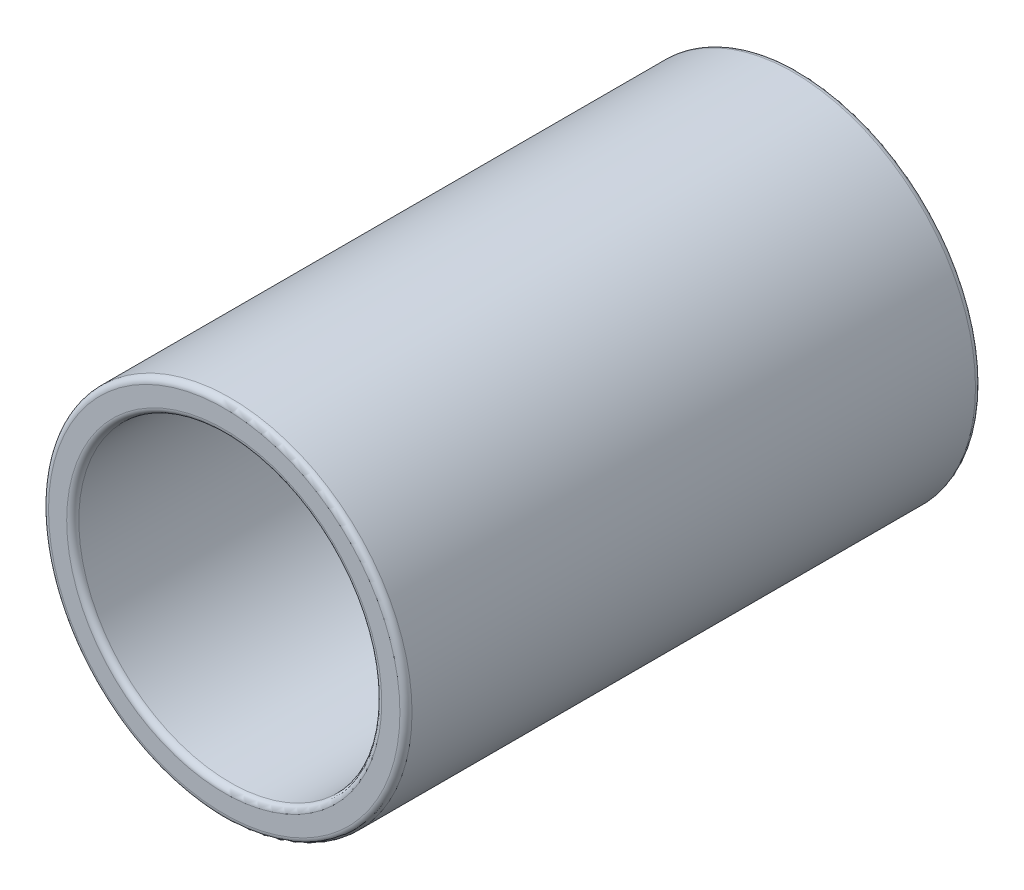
ISO-10303-21;
HEADER;
FILE_DESCRIPTION(('STEP AP214'),'2;1');
FILE_NAME('part.step','',(''),(''),'','','');
FILE_SCHEMA(('AUTOMOTIVE_DESIGN { 1 0 10303 214 1 1 1 1 }'));
ENDSEC;
DATA;
#1=APPLICATION_CONTEXT('core data for automotive mechanical design processes');
#2=APPLICATION_PROTOCOL_DEFINITION('international standard','automotive_design',2000,#1);
#3=PRODUCT_CONTEXT('',#1,'mechanical');
#4=PRODUCT('Part','Part','',(#3));
#5=PRODUCT_RELATED_PRODUCT_CATEGORY('part','',(#4));
#6=PRODUCT_DEFINITION_FORMATION('','',#4);
#7=PRODUCT_DEFINITION_CONTEXT('part definition',#1,'design');
#8=PRODUCT_DEFINITION('design','',#6,#7);
#9=PRODUCT_DEFINITION_SHAPE('','',#8);
#10=(LENGTH_UNIT() NAMED_UNIT(*) SI_UNIT(.MILLI.,.METRE.));
#11=(NAMED_UNIT(*) PLANE_ANGLE_UNIT() SI_UNIT($,.RADIAN.));
#12=(NAMED_UNIT(*) SI_UNIT($,.STERADIAN.) SOLID_ANGLE_UNIT());
#13=UNCERTAINTY_MEASURE_WITH_UNIT(LENGTH_MEASURE(1.E-05),#10,'distance_accuracy_value','');
#14=(GEOMETRIC_REPRESENTATION_CONTEXT(3) GLOBAL_UNCERTAINTY_ASSIGNED_CONTEXT((#13)) GLOBAL_UNIT_ASSIGNED_CONTEXT((#10,
#11,#12)) REPRESENTATION_CONTEXT('',''));
#15=CARTESIAN_POINT('',(0.,0.,0.));
#16=DIRECTION('',(0.,0.,1.));
#17=DIRECTION('',(1.,0.,0.));
#18=AXIS2_PLACEMENT_3D('',#15,#16,#17);
#19=CARTESIAN_POINT('',(0.,0.,9.5));
#20=DIRECTION('',(0.,0.,1.));
#21=DIRECTION('',(1.,0.,0.));
#22=AXIS2_PLACEMENT_3D('',#19,#20,#21);
#23=PLANE('',#22);
#24=CARTESIAN_POINT('',(0.,0.,9.5));
#25=DIRECTION('',(0.,0.,1.));
#26=DIRECTION('',(1.,0.,0.));
#27=AXIS2_PLACEMENT_3D('',#24,#25,#26);
#28=CIRCLE('',#27,2.6);
#29=CARTESIAN_POINT('',(2.6,0.,9.5));
#30=VERTEX_POINT('',#29);
#31=EDGE_CURVE('E39',#30,#30,#28,.F.);
#32=ORIENTED_EDGE('',*,*,#31,.T.);
#33=EDGE_LOOP('',(#32));
#34=FACE_BOUND('',#33,.T.);
#35=CARTESIAN_POINT('',(0.,0.,9.5));
#36=DIRECTION('',(0.,0.,1.));
#37=DIRECTION('',(1.,0.,0.));
#38=AXIS2_PLACEMENT_3D('',#35,#36,#37);
#39=CIRCLE('',#38,2.9);
#40=CARTESIAN_POINT('',(2.9,0.,9.5));
#41=VERTEX_POINT('',#40);
#42=EDGE_CURVE('E43',#41,#41,#39,.T.);
#43=ORIENTED_EDGE('',*,*,#42,.T.);
#44=EDGE_LOOP('',(#43));
#45=FACE_BOUND('',#44,.T.);
#46=ADVANCED_FACE('F28',(#34,#45),#23,.T.);
#47=CARTESIAN_POINT('',(0.,0.,0.));
#48=DIRECTION('',(0.,0.,1.));
#49=DIRECTION('',(1.,0.,0.));
#50=AXIS2_PLACEMENT_3D('',#47,#48,#49);
#51=PLANE('',#50);
#52=CARTESIAN_POINT('',(0.,0.,0.));
#53=DIRECTION('',(0.,0.,1.));
#54=DIRECTION('',(1.,0.,0.));
#55=AXIS2_PLACEMENT_3D('',#52,#53,#54);
#56=CIRCLE('',#55,2.6);
#57=CARTESIAN_POINT('',(2.6,0.,0.));
#58=VERTEX_POINT('',#57);
#59=EDGE_CURVE('E54',#58,#58,#56,.T.);
#60=ORIENTED_EDGE('',*,*,#59,.T.);
#61=EDGE_LOOP('',(#60));
#62=FACE_BOUND('',#61,.T.);
#63=CARTESIAN_POINT('',(0.,0.,0.));
#64=DIRECTION('',(0.,0.,1.));
#65=DIRECTION('',(1.,0.,0.));
#66=AXIS2_PLACEMENT_3D('',#63,#64,#65);
#67=CIRCLE('',#66,2.9);
#68=CARTESIAN_POINT('',(2.9,0.,0.));
#69=VERTEX_POINT('',#68);
#70=EDGE_CURVE('E57',#69,#69,#67,.F.);
#71=ORIENTED_EDGE('',*,*,#70,.T.);
#72=EDGE_LOOP('',(#71));
#73=FACE_BOUND('',#72,.T.);
#74=ADVANCED_FACE('F61',(#62,#73),#51,.F.);
#75=CARTESIAN_POINT('',(0.,0.,9.5));
#76=DIRECTION('',(0.,0.,-1.));
#77=DIRECTION('',(-1.,0.,0.));
#78=AXIS2_PLACEMENT_3D('',#75,#76,#77);
#79=CYLINDRICAL_SURFACE('',#78,3.);
#80=CARTESIAN_POINT('',(0.,0.,0.0999999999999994));
#81=DIRECTION('',(0.,0.,1.));
#82=DIRECTION('',(1.,0.,0.));
#83=AXIS2_PLACEMENT_3D('',#80,#81,#82);
#84=CIRCLE('',#83,3.);
#85=CARTESIAN_POINT('',(3.,0.,0.0999999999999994));
#86=VERTEX_POINT('',#85);
#87=EDGE_CURVE('E10',#86,#86,#84,.T.);
#88=ORIENTED_EDGE('',*,*,#87,.T.);
#89=EDGE_LOOP('',(#88));
#90=FACE_BOUND('',#89,.T.);
#91=CARTESIAN_POINT('',(0.,0.,9.4));
#92=DIRECTION('',(0.,0.,1.));
#93=DIRECTION('',(1.,0.,0.));
#94=AXIS2_PLACEMENT_3D('',#91,#92,#93);
#95=CIRCLE('',#94,3.);
#96=CARTESIAN_POINT('',(3.,0.,9.4));
#97=VERTEX_POINT('',#96);
#98=EDGE_CURVE('E35',#97,#97,#95,.F.);
#99=ORIENTED_EDGE('',*,*,#98,.T.);
#100=EDGE_LOOP('',(#99));
#101=FACE_BOUND('',#100,.T.);
#102=ADVANCED_FACE('F30',(#90,#101),#79,.T.);
#103=CARTESIAN_POINT('',(0.,0.,9.5));
#104=DIRECTION('',(0.,0.,-1.));
#105=DIRECTION('',(-1.,0.,0.));
#106=AXIS2_PLACEMENT_3D('',#103,#104,#105);
#107=CYLINDRICAL_SURFACE('',#106,2.5);
#108=CARTESIAN_POINT('',(0.,0.,0.0999999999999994));
#109=DIRECTION('',(0.,0.,1.));
#110=DIRECTION('',(1.,0.,0.));
#111=AXIS2_PLACEMENT_3D('',#108,#109,#110);
#112=CIRCLE('',#111,2.5);
#113=CARTESIAN_POINT('',(2.5,0.,0.0999999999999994));
#114=VERTEX_POINT('',#113);
#115=EDGE_CURVE('E48',#114,#114,#112,.F.);
#116=ORIENTED_EDGE('',*,*,#115,.T.);
#117=EDGE_LOOP('',(#116));
#118=FACE_BOUND('',#117,.T.);
#119=CARTESIAN_POINT('',(0.,0.,9.4));
#120=DIRECTION('',(0.,0.,1.));
#121=DIRECTION('',(1.,0.,0.));
#122=AXIS2_PLACEMENT_3D('',#119,#120,#121);
#123=CIRCLE('',#122,2.5);
#124=CARTESIAN_POINT('',(2.5,0.,9.4));
#125=VERTEX_POINT('',#124);
#126=EDGE_CURVE('E51',#125,#125,#123,.T.);
#127=ORIENTED_EDGE('',*,*,#126,.T.);
#128=EDGE_LOOP('',(#127));
#129=FACE_BOUND('',#128,.T.);
#130=ADVANCED_FACE('F87',(#118,#129),#107,.F.);
#131=CARTESIAN_POINT('',(0.,0.,0.0999999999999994));
#132=DIRECTION('',(0.,0.,1.));
#133=DIRECTION('',(1.,0.,0.));
#134=AXIS2_PLACEMENT_3D('',#131,#132,#133);
#135=TOROIDAL_SURFACE('',#134,2.6,0.1);
#136=ORIENTED_EDGE('',*,*,#115,.F.);
#137=EDGE_LOOP('',(#136));
#138=FACE_BOUND('',#137,.T.);
#139=ORIENTED_EDGE('',*,*,#59,.F.);
#140=EDGE_LOOP('',(#139));
#141=FACE_BOUND('',#140,.T.);
#142=ADVANCED_FACE('F75',(#138,#141),#135,.T.);
#143=CARTESIAN_POINT('',(0.,0.,9.4));
#144=DIRECTION('',(0.,0.,1.));
#145=DIRECTION('',(1.,0.,0.));
#146=AXIS2_PLACEMENT_3D('',#143,#144,#145);
#147=TOROIDAL_SURFACE('',#146,2.6,0.1);
#148=ORIENTED_EDGE('',*,*,#31,.F.);
#149=EDGE_LOOP('',(#148));
#150=FACE_BOUND('',#149,.T.);
#151=ORIENTED_EDGE('',*,*,#126,.F.);
#152=EDGE_LOOP('',(#151));
#153=FACE_BOUND('',#152,.T.);
#154=ADVANCED_FACE('F67',(#150,#153),#147,.T.);
#155=CARTESIAN_POINT('',(0.,0.,0.0999999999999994));
#156=DIRECTION('',(0.,0.,1.));
#157=DIRECTION('',(1.,0.,0.));
#158=AXIS2_PLACEMENT_3D('',#155,#156,#157);
#159=TOROIDAL_SURFACE('',#158,2.9,0.1);
#160=ORIENTED_EDGE('',*,*,#70,.F.);
#161=EDGE_LOOP('',(#160));
#162=FACE_BOUND('',#161,.T.);
#163=ORIENTED_EDGE('',*,*,#87,.F.);
#164=EDGE_LOOP('',(#163));
#165=FACE_BOUND('',#164,.T.);
#166=ADVANCED_FACE('F63',(#162,#165),#159,.T.);
#167=CARTESIAN_POINT('',(0.,0.,9.4));
#168=DIRECTION('',(0.,0.,1.));
#169=DIRECTION('',(1.,0.,0.));
#170=AXIS2_PLACEMENT_3D('',#167,#168,#169);
#171=TOROIDAL_SURFACE('',#170,2.9,0.1);
#172=ORIENTED_EDGE('',*,*,#98,.F.);
#173=EDGE_LOOP('',(#172));
#174=FACE_BOUND('',#173,.T.);
#175=ORIENTED_EDGE('',*,*,#42,.F.);
#176=EDGE_LOOP('',(#175));
#177=FACE_BOUND('',#176,.T.);
#178=ADVANCED_FACE('F66',(#174,#177),#171,.T.);
#179=CLOSED_SHELL('',(#46,#74,#102,#130,#142,#154,#166,#178));
#180=MANIFOLD_SOLID_BREP('B2',#179);
#181=ADVANCED_BREP_SHAPE_REPRESENTATION('',(#18,#180),#14);
#182=SHAPE_DEFINITION_REPRESENTATION(#9,#181);
ENDSEC;
END-ISO-10303-21;
